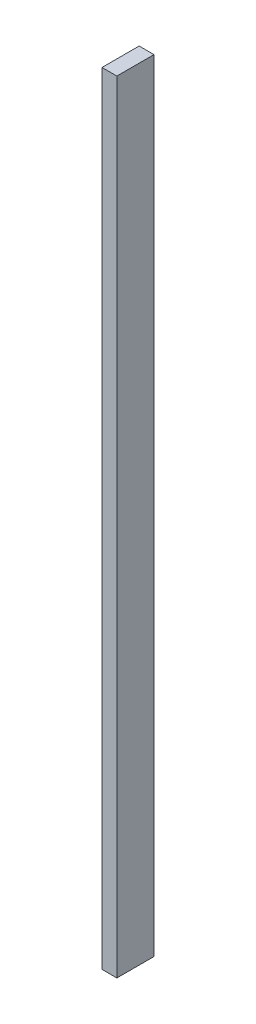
ISO-10303-21;
HEADER;
FILE_DESCRIPTION(('STEP AP214'),'2;1');
FILE_NAME('part.step','',(''),(''),'','','');
FILE_SCHEMA(('AUTOMOTIVE_DESIGN { 1 0 10303 214 1 1 1 1 }'));
ENDSEC;
DATA;
#1=APPLICATION_CONTEXT('core data for automotive mechanical design processes');
#2=APPLICATION_PROTOCOL_DEFINITION('international standard','automotive_design',2000,#1);
#3=PRODUCT_CONTEXT('',#1,'mechanical');
#4=PRODUCT('Part','Part','',(#3));
#5=PRODUCT_RELATED_PRODUCT_CATEGORY('part','',(#4));
#6=PRODUCT_DEFINITION_FORMATION('','',#4);
#7=PRODUCT_DEFINITION_CONTEXT('part definition',#1,'design');
#8=PRODUCT_DEFINITION('design','',#6,#7);
#9=PRODUCT_DEFINITION_SHAPE('','',#8);
#10=(LENGTH_UNIT() NAMED_UNIT(*) SI_UNIT(.MILLI.,.METRE.));
#11=(NAMED_UNIT(*) PLANE_ANGLE_UNIT() SI_UNIT($,.RADIAN.));
#12=(NAMED_UNIT(*) SI_UNIT($,.STERADIAN.) SOLID_ANGLE_UNIT());
#13=UNCERTAINTY_MEASURE_WITH_UNIT(LENGTH_MEASURE(1.E-05),#10,'distance_accuracy_value','');
#14=(GEOMETRIC_REPRESENTATION_CONTEXT(3) GLOBAL_UNCERTAINTY_ASSIGNED_CONTEXT((#13)) GLOBAL_UNIT_ASSIGNED_CONTEXT((#10,
#11,#12)) REPRESENTATION_CONTEXT('',''));
#15=CARTESIAN_POINT('',(0.,0.,0.));
#16=DIRECTION('',(0.,0.,1.));
#17=DIRECTION('',(1.,0.,0.));
#18=AXIS2_PLACEMENT_3D('',#15,#16,#17);
#19=CARTESIAN_POINT('',(0.,1051.,0.));
#20=DIRECTION('',(1.,0.,0.));
#21=DIRECTION('',(0.,0.,-1.));
#22=AXIS2_PLACEMENT_3D('',#19,#20,#21);
#23=PLANE('',#22);
#24=DIRECTION('',(0.,0.,1.));
#25=VECTOR('',#24,1.);
#26=CARTESIAN_POINT('',(0.,0.,0.));
#27=LINE('',#26,#25);
#28=CARTESIAN_POINT('',(0.,0.,-50.));
#29=VERTEX_POINT('',#28);
#30=CARTESIAN_POINT('',(0.,0.,0.));
#31=VERTEX_POINT('',#30);
#32=EDGE_CURVE('E95',#29,#31,#27,.T.);
#33=ORIENTED_EDGE('',*,*,#32,.T.);
#34=DIRECTION('',(0.,-1.,0.));
#35=VECTOR('',#34,1.);
#36=CARTESIAN_POINT('',(0.,1051.,0.));
#37=LINE('',#36,#35);
#38=CARTESIAN_POINT('',(0.,1051.,0.));
#39=VERTEX_POINT('',#38);
#40=EDGE_CURVE('E11',#39,#31,#37,.T.);
#41=ORIENTED_EDGE('',*,*,#40,.F.);
#42=DIRECTION('',(0.,0.,1.));
#43=VECTOR('',#42,1.);
#44=CARTESIAN_POINT('',(0.,1051.,0.));
#45=LINE('',#44,#43);
#46=CARTESIAN_POINT('',(0.,1051.,-50.));
#47=VERTEX_POINT('',#46);
#48=EDGE_CURVE('E83',#47,#39,#45,.T.);
#49=ORIENTED_EDGE('',*,*,#48,.F.);
#50=DIRECTION('',(0.,-1.,0.));
#51=VECTOR('',#50,1.);
#52=CARTESIAN_POINT('',(0.,1051.,-50.));
#53=LINE('',#52,#51);
#54=EDGE_CURVE('E91',#47,#29,#53,.T.);
#55=ORIENTED_EDGE('',*,*,#54,.T.);
#56=EDGE_LOOP('',(#33,#41,#49,#55));
#57=FACE_BOUND('',#56,.T.);
#58=ADVANCED_FACE('F32',(#57),#23,.F.);
#59=CARTESIAN_POINT('',(0.,1051.,0.));
#60=DIRECTION('',(0.,0.,-1.));
#61=DIRECTION('',(-1.,0.,0.));
#62=AXIS2_PLACEMENT_3D('',#59,#60,#61);
#63=PLANE('',#62);
#64=DIRECTION('',(1.,0.,0.));
#65=VECTOR('',#64,1.);
#66=CARTESIAN_POINT('',(0.,0.,0.));
#67=LINE('',#66,#65);
#68=CARTESIAN_POINT('',(20.,0.,0.));
#69=VERTEX_POINT('',#68);
#70=EDGE_CURVE('E87',#31,#69,#67,.T.);
#71=ORIENTED_EDGE('',*,*,#70,.T.);
#72=DIRECTION('',(0.,-1.,0.));
#73=VECTOR('',#72,1.);
#74=CARTESIAN_POINT('',(20.,1051.,0.));
#75=LINE('',#74,#73);
#76=CARTESIAN_POINT('',(20.,1051.,0.));
#77=VERTEX_POINT('',#76);
#78=EDGE_CURVE('E40',#77,#69,#75,.T.);
#79=ORIENTED_EDGE('',*,*,#78,.F.);
#80=DIRECTION('',(1.,0.,0.));
#81=VECTOR('',#80,1.);
#82=CARTESIAN_POINT('',(0.,1051.,0.));
#83=LINE('',#82,#81);
#84=EDGE_CURVE('E78',#39,#77,#83,.T.);
#85=ORIENTED_EDGE('',*,*,#84,.F.);
#86=ORIENTED_EDGE('',*,*,#40,.T.);
#87=EDGE_LOOP('',(#71,#79,#85,#86));
#88=FACE_BOUND('',#87,.T.);
#89=ADVANCED_FACE('F86',(#88),#63,.F.);
#90=CARTESIAN_POINT('',(20.,1051.,0.));
#91=DIRECTION('',(-1.,0.,0.));
#92=DIRECTION('',(0.,0.,1.));
#93=AXIS2_PLACEMENT_3D('',#90,#91,#92);
#94=PLANE('',#93);
#95=DIRECTION('',(0.,0.,-1.));
#96=VECTOR('',#95,1.);
#97=CARTESIAN_POINT('',(20.,0.,0.));
#98=LINE('',#97,#96);
#99=CARTESIAN_POINT('',(20.,0.,-50.));
#100=VERTEX_POINT('',#99);
#101=EDGE_CURVE('E65',#69,#100,#98,.T.);
#102=ORIENTED_EDGE('',*,*,#101,.T.);
#103=DIRECTION('',(0.,-1.,0.));
#104=VECTOR('',#103,1.);
#105=CARTESIAN_POINT('',(20.,1051.,-50.));
#106=LINE('',#105,#104);
#107=CARTESIAN_POINT('',(20.,1051.,-50.));
#108=VERTEX_POINT('',#107);
#109=EDGE_CURVE('E88',#108,#100,#106,.T.);
#110=ORIENTED_EDGE('',*,*,#109,.F.);
#111=DIRECTION('',(0.,0.,-1.));
#112=VECTOR('',#111,1.);
#113=CARTESIAN_POINT('',(20.,1051.,0.));
#114=LINE('',#113,#112);
#115=EDGE_CURVE('E81',#77,#108,#114,.T.);
#116=ORIENTED_EDGE('',*,*,#115,.F.);
#117=ORIENTED_EDGE('',*,*,#78,.T.);
#118=EDGE_LOOP('',(#102,#110,#116,#117));
#119=FACE_BOUND('',#118,.T.);
#120=ADVANCED_FACE('F89',(#119),#94,.F.);
#121=CARTESIAN_POINT('',(0.,1051.,-50.));
#122=DIRECTION('',(0.,0.,1.));
#123=DIRECTION('',(1.,0.,0.));
#124=AXIS2_PLACEMENT_3D('',#121,#122,#123);
#125=PLANE('',#124);
#126=DIRECTION('',(-1.,0.,0.));
#127=VECTOR('',#126,1.);
#128=CARTESIAN_POINT('',(0.,0.,-50.));
#129=LINE('',#128,#127);
#130=EDGE_CURVE('E71',#100,#29,#129,.T.);
#131=ORIENTED_EDGE('',*,*,#130,.T.);
#132=ORIENTED_EDGE('',*,*,#54,.F.);
#133=DIRECTION('',(-1.,0.,0.));
#134=VECTOR('',#133,1.);
#135=CARTESIAN_POINT('',(0.,1051.,-50.));
#136=LINE('',#135,#134);
#137=EDGE_CURVE('E48',#108,#47,#136,.T.);
#138=ORIENTED_EDGE('',*,*,#137,.F.);
#139=ORIENTED_EDGE('',*,*,#109,.T.);
#140=EDGE_LOOP('',(#131,#132,#138,#139));
#141=FACE_BOUND('',#140,.T.);
#142=ADVANCED_FACE('F102',(#141),#125,.F.);
#143=CARTESIAN_POINT('',(0.,1051.,-50.));
#144=DIRECTION('',(0.,-1.,0.));
#145=DIRECTION('',(0.,0.,-1.));
#146=AXIS2_PLACEMENT_3D('',#143,#144,#145);
#147=PLANE('',#146);
#148=ORIENTED_EDGE('',*,*,#48,.T.);
#149=ORIENTED_EDGE('',*,*,#84,.T.);
#150=ORIENTED_EDGE('',*,*,#115,.T.);
#151=ORIENTED_EDGE('',*,*,#137,.T.);
#152=EDGE_LOOP('',(#148,#149,#150,#151));
#153=FACE_BOUND('',#152,.T.);
#154=ADVANCED_FACE('F79',(#153),#147,.F.);
#155=CARTESIAN_POINT('',(0.,0.,-50.));
#156=DIRECTION('',(0.,-1.,0.));
#157=DIRECTION('',(0.,0.,-1.));
#158=AXIS2_PLACEMENT_3D('',#155,#156,#157);
#159=PLANE('',#158);
#160=ORIENTED_EDGE('',*,*,#32,.F.);
#161=ORIENTED_EDGE('',*,*,#130,.F.);
#162=ORIENTED_EDGE('',*,*,#101,.F.);
#163=ORIENTED_EDGE('',*,*,#70,.F.);
#164=EDGE_LOOP('',(#160,#161,#162,#163));
#165=FACE_BOUND('',#164,.T.);
#166=ADVANCED_FACE('F105',(#165),#159,.T.);
#167=CLOSED_SHELL('',(#58,#89,#120,#142,#154,#166));
#168=MANIFOLD_SOLID_BREP('B2',#167);
#169=ADVANCED_BREP_SHAPE_REPRESENTATION('',(#18,#168),#14);
#170=SHAPE_DEFINITION_REPRESENTATION(#9,#169);
ENDSEC;
END-ISO-10303-21;
